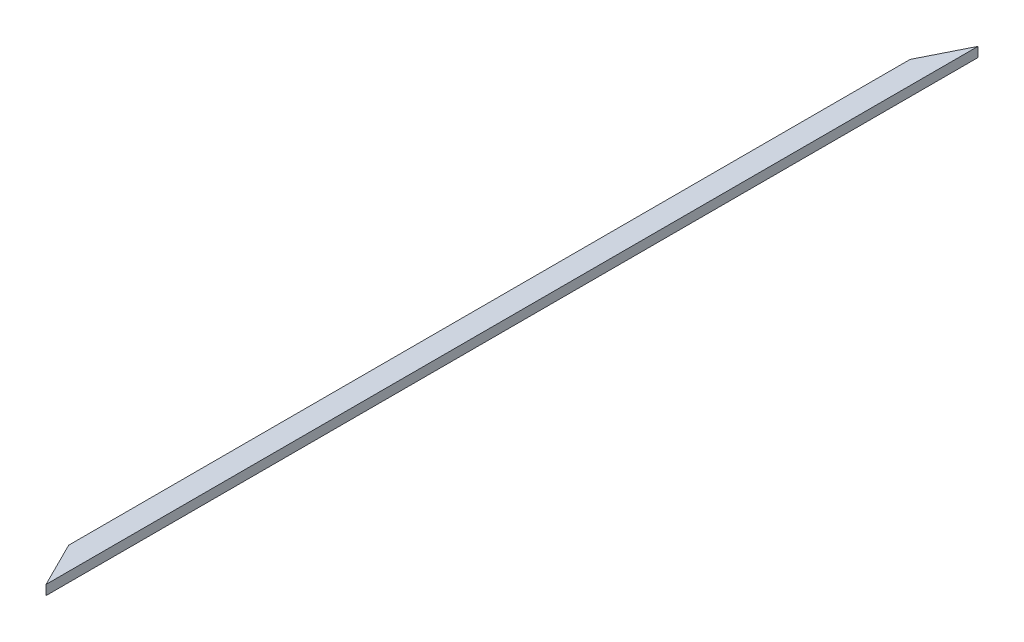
from build123d import *

# Parameters (mm, degrees)
BOSS_EXTRUDE1_DEPTH = 38.1


with BuildPart() as part:
    # Sketch1 → Boss-Extrude1 (new body)
    with BuildSketch(Plane(origin=(0, 0, 0), x_dir=(1, 0, 0), z_dir=(0, 1, 0))):
        Polygon((0, 0), (0, -3657.6), (-88.9, -3479.83838628), (-88.9, -177.76161372), align=None)
    extrude(amount=BOSS_EXTRUDE1_DEPTH)


solid = part.part
